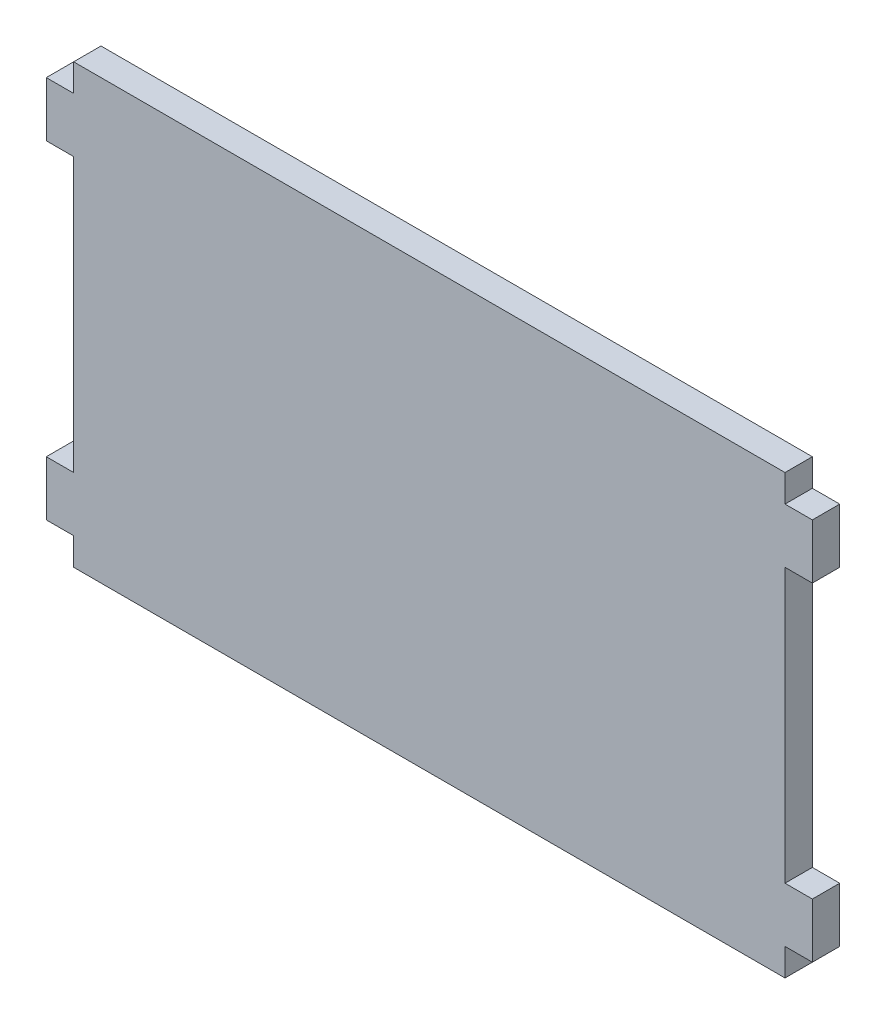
from build123d import *

# Parameters (mm, degrees)
BOSS_EXTRUDE1_DEPTH = 3.175


with BuildPart() as part:
    # Sketch1 → Boss-Extrude1 (new body)
    with BuildSketch(Plane.XY):
        Polygon((0, 0), (82.55, 0), (82.55, 3.175), (85.725, 3.175), (85.725, 9.525), (82.55, 9.525), (82.55, 41.275), (85.725, 41.275), (85.725, 47.625), (82.55, 47.625), (82.55, 50.8), (0, 50.8), (0, 47.625), (-3.175, 47.625), (-3.175, 41.275), (0, 41.275), (0, 9.525), (-3.175, 9.525), (-3.175, 3.175), (0, 3.175), align=None)
    extrude(amount=BOSS_EXTRUDE1_DEPTH)


solid = part.part
